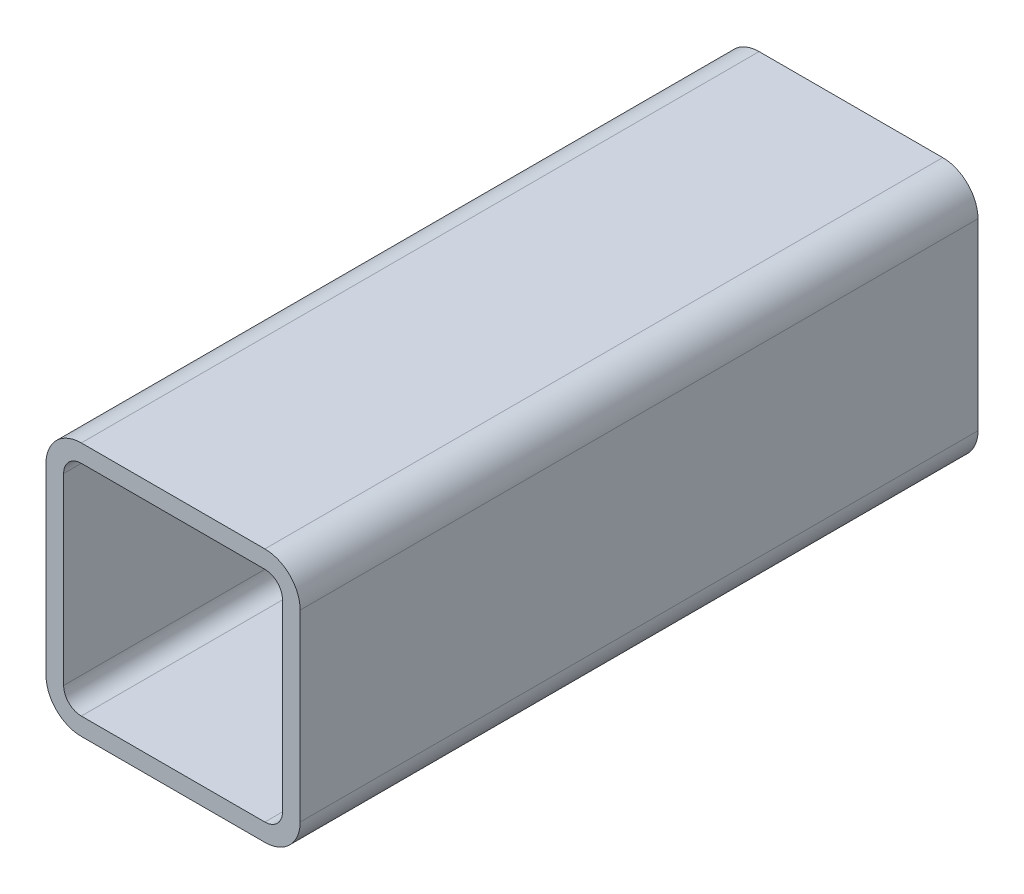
ISO-10303-21;
HEADER;
FILE_DESCRIPTION(('STEP AP214'),'2;1');
FILE_NAME('part.step','',(''),(''),'','','');
FILE_SCHEMA(('AUTOMOTIVE_DESIGN { 1 0 10303 214 1 1 1 1 }'));
ENDSEC;
DATA;
#1=APPLICATION_CONTEXT('core data for automotive mechanical design processes');
#2=APPLICATION_PROTOCOL_DEFINITION('international standard','automotive_design',2000,#1);
#3=PRODUCT_CONTEXT('',#1,'mechanical');
#4=PRODUCT('Part','Part','',(#3));
#5=PRODUCT_RELATED_PRODUCT_CATEGORY('part','',(#4));
#6=PRODUCT_DEFINITION_FORMATION('','',#4);
#7=PRODUCT_DEFINITION_CONTEXT('part definition',#1,'design');
#8=PRODUCT_DEFINITION('design','',#6,#7);
#9=PRODUCT_DEFINITION_SHAPE('','',#8);
#10=(LENGTH_UNIT() NAMED_UNIT(*) SI_UNIT(.MILLI.,.METRE.));
#11=(NAMED_UNIT(*) PLANE_ANGLE_UNIT() SI_UNIT($,.RADIAN.));
#12=(NAMED_UNIT(*) SI_UNIT($,.STERADIAN.) SOLID_ANGLE_UNIT());
#13=UNCERTAINTY_MEASURE_WITH_UNIT(LENGTH_MEASURE(1.E-05),#10,'distance_accuracy_value','');
#14=(GEOMETRIC_REPRESENTATION_CONTEXT(3) GLOBAL_UNCERTAINTY_ASSIGNED_CONTEXT((#13)) GLOBAL_UNIT_ASSIGNED_CONTEXT((#10,
#11,#12)) REPRESENTATION_CONTEXT('',''));
#15=CARTESIAN_POINT('',(0.,0.,0.));
#16=DIRECTION('',(0.,0.,1.));
#17=DIRECTION('',(1.,0.,0.));
#18=AXIS2_PLACEMENT_3D('',#15,#16,#17);
#19=CARTESIAN_POINT('',(17.1432087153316,99.2036017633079,304.8));
#20=DIRECTION('',(0.,0.,1.));
#21=DIRECTION('',(1.,0.,0.));
#22=AXIS2_PLACEMENT_3D('',#19,#20,#21);
#23=PLANE('',#22);
#24=CARTESIAN_POINT('',(17.1432087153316,99.2036017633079,304.8));
#25=DIRECTION('',(0.,0.,1.));
#26=DIRECTION('',(1.,0.,0.));
#27=AXIS2_PLACEMENT_3D('',#24,#25,#26);
#28=CIRCLE('',#27,15.875);
#29=CARTESIAN_POINT('',(17.1432087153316,115.078601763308,304.8));
#30=VERTEX_POINT('',#29);
#31=CARTESIAN_POINT('',(1.26820871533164,99.2036017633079,304.8));
#32=VERTEX_POINT('',#31);
#33=EDGE_CURVE('E211',#30,#32,#28,.T.);
#34=ORIENTED_EDGE('',*,*,#33,.T.);
#35=DIRECTION('',(0.,-1.,0.));
#36=VECTOR('',#35,1.);
#37=CARTESIAN_POINT('',(1.26820871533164,16.6536017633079,304.8));
#38=LINE('',#37,#36);
#39=CARTESIAN_POINT('',(1.26820871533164,16.6536017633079,304.8));
#40=VERTEX_POINT('',#39);
#41=EDGE_CURVE('E214',#32,#40,#38,.T.);
#42=ORIENTED_EDGE('',*,*,#41,.T.);
#43=CARTESIAN_POINT('',(17.1432087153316,16.6536017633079,304.8));
#44=DIRECTION('',(0.,0.,1.));
#45=DIRECTION('',(1.,0.,0.));
#46=AXIS2_PLACEMENT_3D('',#43,#44,#45);
#47=CIRCLE('',#46,15.875);
#48=CARTESIAN_POINT('',(17.1432087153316,0.77860176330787,304.8));
#49=VERTEX_POINT('',#48);
#50=EDGE_CURVE('E217',#40,#49,#47,.T.);
#51=ORIENTED_EDGE('',*,*,#50,.T.);
#52=DIRECTION('',(1.,0.,0.));
#53=VECTOR('',#52,1.);
#54=CARTESIAN_POINT('',(99.6932087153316,0.77860176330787,304.8));
#55=LINE('',#54,#53);
#56=CARTESIAN_POINT('',(99.6932087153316,0.778601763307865,304.8));
#57=VERTEX_POINT('',#56);
#58=EDGE_CURVE('E219',#49,#57,#55,.T.);
#59=ORIENTED_EDGE('',*,*,#58,.T.);
#60=CARTESIAN_POINT('',(99.6932087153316,16.6536017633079,304.8));
#61=DIRECTION('',(0.,0.,1.));
#62=DIRECTION('',(1.,0.,0.));
#63=AXIS2_PLACEMENT_3D('',#60,#61,#62);
#64=CIRCLE('',#63,15.875);
#65=CARTESIAN_POINT('',(115.568208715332,16.6536017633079,304.8));
#66=VERTEX_POINT('',#65);
#67=EDGE_CURVE('E221',#57,#66,#64,.T.);
#68=ORIENTED_EDGE('',*,*,#67,.T.);
#69=DIRECTION('',(0.,1.,0.));
#70=VECTOR('',#69,1.);
#71=CARTESIAN_POINT('',(115.568208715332,99.2036017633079,304.8));
#72=LINE('',#71,#70);
#73=CARTESIAN_POINT('',(115.568208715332,99.2036017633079,304.8));
#74=VERTEX_POINT('',#73);
#75=EDGE_CURVE('E223',#66,#74,#72,.T.);
#76=ORIENTED_EDGE('',*,*,#75,.T.);
#77=CARTESIAN_POINT('',(99.6932087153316,99.2036017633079,304.8));
#78=DIRECTION('',(0.,0.,1.));
#79=DIRECTION('',(1.,0.,0.));
#80=AXIS2_PLACEMENT_3D('',#77,#78,#79);
#81=CIRCLE('',#80,15.875);
#82=CARTESIAN_POINT('',(99.6932087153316,115.078601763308,304.8));
#83=VERTEX_POINT('',#82);
#84=EDGE_CURVE('E225',#74,#83,#81,.T.);
#85=ORIENTED_EDGE('',*,*,#84,.T.);
#86=DIRECTION('',(-1.,0.,0.));
#87=VECTOR('',#86,1.);
#88=CARTESIAN_POINT('',(17.1432087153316,115.078601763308,304.8));
#89=LINE('',#88,#87);
#90=EDGE_CURVE('E227',#83,#30,#89,.T.);
#91=ORIENTED_EDGE('',*,*,#90,.T.);
#92=EDGE_LOOP('',(#34,#42,#51,#59,#68,#76,#85,#91));
#93=FACE_BOUND('',#92,.T.);
#94=DIRECTION('',(0.,-1.,0.));
#95=VECTOR('',#94,1.);
#96=CARTESIAN_POINT('',(9.20570871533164,16.6536017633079,304.8));
#97=LINE('',#96,#95);
#98=CARTESIAN_POINT('',(9.20570871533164,99.2036017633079,304.8));
#99=VERTEX_POINT('',#98);
#100=CARTESIAN_POINT('',(9.20570871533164,16.6536017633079,304.8));
#101=VERTEX_POINT('',#100);
#102=EDGE_CURVE('E154',#99,#101,#97,.T.);
#103=ORIENTED_EDGE('',*,*,#102,.F.);
#104=CARTESIAN_POINT('',(17.1432087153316,99.2036017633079,304.8));
#105=DIRECTION('',(0.,0.,1.));
#106=DIRECTION('',(1.,0.,0.));
#107=AXIS2_PLACEMENT_3D('',#104,#105,#106);
#108=CIRCLE('',#107,7.9375);
#109=CARTESIAN_POINT('',(17.1432087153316,107.141101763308,304.8));
#110=VERTEX_POINT('',#109);
#111=EDGE_CURVE('E146',#110,#99,#108,.T.);
#112=ORIENTED_EDGE('',*,*,#111,.F.);
#113=DIRECTION('',(-1.,0.,0.));
#114=VECTOR('',#113,1.);
#115=CARTESIAN_POINT('',(17.1432087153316,107.141101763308,304.8));
#116=LINE('',#115,#114);
#117=CARTESIAN_POINT('',(99.6932087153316,107.141101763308,304.8));
#118=VERTEX_POINT('',#117);
#119=EDGE_CURVE('E179',#118,#110,#116,.T.);
#120=ORIENTED_EDGE('',*,*,#119,.F.);
#121=CARTESIAN_POINT('',(99.6932087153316,99.2036017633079,304.8));
#122=DIRECTION('',(0.,0.,1.));
#123=DIRECTION('',(1.,0.,0.));
#124=AXIS2_PLACEMENT_3D('',#121,#122,#123);
#125=CIRCLE('',#124,7.9375);
#126=CARTESIAN_POINT('',(107.630708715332,99.2036017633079,304.8));
#127=VERTEX_POINT('',#126);
#128=EDGE_CURVE('E177',#127,#118,#125,.T.);
#129=ORIENTED_EDGE('',*,*,#128,.F.);
#130=DIRECTION('',(0.,1.,0.));
#131=VECTOR('',#130,1.);
#132=CARTESIAN_POINT('',(107.630708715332,99.2036017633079,304.8));
#133=LINE('',#132,#131);
#134=CARTESIAN_POINT('',(107.630708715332,16.6536017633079,304.8));
#135=VERTEX_POINT('',#134);
#136=EDGE_CURVE('E175',#135,#127,#133,.T.);
#137=ORIENTED_EDGE('',*,*,#136,.F.);
#138=CARTESIAN_POINT('',(99.6932087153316,16.6536017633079,304.8));
#139=DIRECTION('',(0.,0.,1.));
#140=DIRECTION('',(1.,0.,0.));
#141=AXIS2_PLACEMENT_3D('',#138,#139,#140);
#142=CIRCLE('',#141,7.93750000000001);
#143=CARTESIAN_POINT('',(99.6932087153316,8.71610176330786,304.8));
#144=VERTEX_POINT('',#143);
#145=EDGE_CURVE('E173',#144,#135,#142,.T.);
#146=ORIENTED_EDGE('',*,*,#145,.F.);
#147=DIRECTION('',(1.,0.,0.));
#148=VECTOR('',#147,1.);
#149=CARTESIAN_POINT('',(99.6932087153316,8.71610176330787,304.8));
#150=LINE('',#149,#148);
#151=CARTESIAN_POINT('',(17.1432087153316,8.71610176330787,304.8));
#152=VERTEX_POINT('',#151);
#153=EDGE_CURVE('E169',#152,#144,#150,.T.);
#154=ORIENTED_EDGE('',*,*,#153,.F.);
#155=CARTESIAN_POINT('',(17.1432087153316,16.6536017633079,304.8));
#156=DIRECTION('',(0.,0.,1.));
#157=DIRECTION('',(1.,0.,0.));
#158=AXIS2_PLACEMENT_3D('',#155,#156,#157);
#159=CIRCLE('',#158,7.9375);
#160=EDGE_CURVE('E167',#101,#152,#159,.T.);
#161=ORIENTED_EDGE('',*,*,#160,.F.);
#162=EDGE_LOOP('',(#103,#112,#120,#129,#137,#146,#154,#161));
#163=FACE_BOUND('',#162,.T.);
#164=ADVANCED_FACE('F33',(#93,#163),#23,.T.);
#165=CARTESIAN_POINT('',(17.1432087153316,99.2036017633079,0.));
#166=DIRECTION('',(0.,0.,1.));
#167=DIRECTION('',(1.,0.,0.));
#168=AXIS2_PLACEMENT_3D('',#165,#166,#167);
#169=PLANE('',#168);
#170=CARTESIAN_POINT('',(17.1432087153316,99.2036017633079,0.));
#171=DIRECTION('',(0.,0.,1.));
#172=DIRECTION('',(1.,0.,0.));
#173=AXIS2_PLACEMENT_3D('',#170,#171,#172);
#174=CIRCLE('',#173,15.875);
#175=CARTESIAN_POINT('',(17.1432087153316,115.078601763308,0.));
#176=VERTEX_POINT('',#175);
#177=CARTESIAN_POINT('',(1.26820871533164,99.2036017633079,0.));
#178=VERTEX_POINT('',#177);
#179=EDGE_CURVE('E162',#176,#178,#174,.T.);
#180=ORIENTED_EDGE('',*,*,#179,.F.);
#181=DIRECTION('',(-1.,0.,0.));
#182=VECTOR('',#181,1.);
#183=CARTESIAN_POINT('',(17.1432087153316,115.078601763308,0.));
#184=LINE('',#183,#182);
#185=CARTESIAN_POINT('',(99.6932087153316,115.078601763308,0.));
#186=VERTEX_POINT('',#185);
#187=EDGE_CURVE('E215',#186,#176,#184,.T.);
#188=ORIENTED_EDGE('',*,*,#187,.F.);
#189=CARTESIAN_POINT('',(99.6932087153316,99.2036017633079,0.));
#190=DIRECTION('',(0.,0.,1.));
#191=DIRECTION('',(1.,0.,0.));
#192=AXIS2_PLACEMENT_3D('',#189,#190,#191);
#193=CIRCLE('',#192,15.875);
#194=CARTESIAN_POINT('',(115.568208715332,99.2036017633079,0.));
#195=VERTEX_POINT('',#194);
#196=EDGE_CURVE('E242',#195,#186,#193,.T.);
#197=ORIENTED_EDGE('',*,*,#196,.F.);
#198=DIRECTION('',(0.,1.,0.));
#199=VECTOR('',#198,1.);
#200=CARTESIAN_POINT('',(115.568208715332,99.2036017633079,0.));
#201=LINE('',#200,#199);
#202=CARTESIAN_POINT('',(115.568208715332,16.6536017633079,0.));
#203=VERTEX_POINT('',#202);
#204=EDGE_CURVE('E240',#203,#195,#201,.T.);
#205=ORIENTED_EDGE('',*,*,#204,.F.);
#206=CARTESIAN_POINT('',(99.6932087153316,16.6536017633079,0.));
#207=DIRECTION('',(0.,0.,1.));
#208=DIRECTION('',(1.,0.,0.));
#209=AXIS2_PLACEMENT_3D('',#206,#207,#208);
#210=CIRCLE('',#209,15.875);
#211=CARTESIAN_POINT('',(99.6932087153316,0.778601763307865,0.));
#212=VERTEX_POINT('',#211);
#213=EDGE_CURVE('E238',#212,#203,#210,.T.);
#214=ORIENTED_EDGE('',*,*,#213,.F.);
#215=DIRECTION('',(1.,0.,0.));
#216=VECTOR('',#215,1.);
#217=CARTESIAN_POINT('',(99.6932087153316,0.77860176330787,0.));
#218=LINE('',#217,#216);
#219=CARTESIAN_POINT('',(17.1432087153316,0.77860176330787,0.));
#220=VERTEX_POINT('',#219);
#221=EDGE_CURVE('E236',#220,#212,#218,.T.);
#222=ORIENTED_EDGE('',*,*,#221,.F.);
#223=CARTESIAN_POINT('',(17.1432087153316,16.6536017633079,0.));
#224=DIRECTION('',(0.,0.,1.));
#225=DIRECTION('',(1.,0.,0.));
#226=AXIS2_PLACEMENT_3D('',#223,#224,#225);
#227=CIRCLE('',#226,15.875);
#228=CARTESIAN_POINT('',(1.26820871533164,16.6536017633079,0.));
#229=VERTEX_POINT('',#228);
#230=EDGE_CURVE('E234',#229,#220,#227,.T.);
#231=ORIENTED_EDGE('',*,*,#230,.F.);
#232=DIRECTION('',(0.,-1.,0.));
#233=VECTOR('',#232,1.);
#234=CARTESIAN_POINT('',(1.26820871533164,16.6536017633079,0.));
#235=LINE('',#234,#233);
#236=EDGE_CURVE('E232',#178,#229,#235,.T.);
#237=ORIENTED_EDGE('',*,*,#236,.F.);
#238=EDGE_LOOP('',(#180,#188,#197,#205,#214,#222,#231,#237));
#239=FACE_BOUND('',#238,.T.);
#240=CARTESIAN_POINT('',(17.1432087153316,99.2036017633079,0.));
#241=DIRECTION('',(0.,0.,1.));
#242=DIRECTION('',(1.,0.,0.));
#243=AXIS2_PLACEMENT_3D('',#240,#241,#242);
#244=CIRCLE('',#243,7.9375);
#245=CARTESIAN_POINT('',(17.1432087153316,107.141101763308,0.));
#246=VERTEX_POINT('',#245);
#247=CARTESIAN_POINT('',(9.20570871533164,99.2036017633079,0.));
#248=VERTEX_POINT('',#247);
#249=EDGE_CURVE('E56',#246,#248,#244,.T.);
#250=ORIENTED_EDGE('',*,*,#249,.T.);
#251=DIRECTION('',(0.,-1.,0.));
#252=VECTOR('',#251,1.);
#253=CARTESIAN_POINT('',(9.20570871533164,16.6536017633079,0.));
#254=LINE('',#253,#252);
#255=CARTESIAN_POINT('',(9.20570871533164,16.6536017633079,0.));
#256=VERTEX_POINT('',#255);
#257=EDGE_CURVE('E161',#248,#256,#254,.T.);
#258=ORIENTED_EDGE('',*,*,#257,.T.);
#259=CARTESIAN_POINT('',(17.1432087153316,16.6536017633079,0.));
#260=DIRECTION('',(0.,0.,1.));
#261=DIRECTION('',(1.,0.,0.));
#262=AXIS2_PLACEMENT_3D('',#259,#260,#261);
#263=CIRCLE('',#262,7.9375);
#264=CARTESIAN_POINT('',(17.1432087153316,8.71610176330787,0.));
#265=VERTEX_POINT('',#264);
#266=EDGE_CURVE('E183',#256,#265,#263,.T.);
#267=ORIENTED_EDGE('',*,*,#266,.T.);
#268=DIRECTION('',(1.,0.,0.));
#269=VECTOR('',#268,1.);
#270=CARTESIAN_POINT('',(99.6932087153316,8.71610176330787,0.));
#271=LINE('',#270,#269);
#272=CARTESIAN_POINT('',(99.6932087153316,8.71610176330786,0.));
#273=VERTEX_POINT('',#272);
#274=EDGE_CURVE('E186',#265,#273,#271,.T.);
#275=ORIENTED_EDGE('',*,*,#274,.T.);
#276=CARTESIAN_POINT('',(99.6932087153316,16.6536017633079,0.));
#277=DIRECTION('',(0.,0.,1.));
#278=DIRECTION('',(1.,0.,0.));
#279=AXIS2_PLACEMENT_3D('',#276,#277,#278);
#280=CIRCLE('',#279,7.93750000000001);
#281=CARTESIAN_POINT('',(107.630708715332,16.6536017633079,0.));
#282=VERTEX_POINT('',#281);
#283=EDGE_CURVE('E189',#273,#282,#280,.T.);
#284=ORIENTED_EDGE('',*,*,#283,.T.);
#285=DIRECTION('',(0.,1.,0.));
#286=VECTOR('',#285,1.);
#287=CARTESIAN_POINT('',(107.630708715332,99.2036017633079,0.));
#288=LINE('',#287,#286);
#289=CARTESIAN_POINT('',(107.630708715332,99.2036017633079,0.));
#290=VERTEX_POINT('',#289);
#291=EDGE_CURVE('E192',#282,#290,#288,.T.);
#292=ORIENTED_EDGE('',*,*,#291,.T.);
#293=CARTESIAN_POINT('',(99.6932087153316,99.2036017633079,0.));
#294=DIRECTION('',(0.,0.,1.));
#295=DIRECTION('',(1.,0.,0.));
#296=AXIS2_PLACEMENT_3D('',#293,#294,#295);
#297=CIRCLE('',#296,7.9375);
#298=CARTESIAN_POINT('',(99.6932087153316,107.141101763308,0.));
#299=VERTEX_POINT('',#298);
#300=EDGE_CURVE('E195',#290,#299,#297,.T.);
#301=ORIENTED_EDGE('',*,*,#300,.T.);
#302=DIRECTION('',(-1.,0.,0.));
#303=VECTOR('',#302,1.);
#304=CARTESIAN_POINT('',(17.1432087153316,107.141101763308,0.));
#305=LINE('',#304,#303);
#306=EDGE_CURVE('E155',#299,#246,#305,.T.);
#307=ORIENTED_EDGE('',*,*,#306,.T.);
#308=EDGE_LOOP('',(#250,#258,#267,#275,#284,#292,#301,#307));
#309=FACE_BOUND('',#308,.T.);
#310=ADVANCED_FACE('F272',(#239,#309),#169,.F.);
#311=CARTESIAN_POINT('',(17.1432087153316,99.2036017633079,304.8));
#312=DIRECTION('',(0.,0.,-1.));
#313=DIRECTION('',(-1.,0.,0.));
#314=AXIS2_PLACEMENT_3D('',#311,#312,#313);
#315=CYLINDRICAL_SURFACE('',#314,15.875);
#316=ORIENTED_EDGE('',*,*,#179,.T.);
#317=DIRECTION('',(0.,0.,-1.));
#318=VECTOR('',#317,1.);
#319=CARTESIAN_POINT('',(1.26820871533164,99.2036017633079,304.8));
#320=LINE('',#319,#318);
#321=EDGE_CURVE('E11',#32,#178,#320,.T.);
#322=ORIENTED_EDGE('',*,*,#321,.F.);
#323=ORIENTED_EDGE('',*,*,#33,.F.);
#324=DIRECTION('',(0.,0.,-1.));
#325=VECTOR('',#324,1.);
#326=CARTESIAN_POINT('',(17.1432087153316,115.078601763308,304.8));
#327=LINE('',#326,#325);
#328=EDGE_CURVE('E229',#30,#176,#327,.T.);
#329=ORIENTED_EDGE('',*,*,#328,.T.);
#330=EDGE_LOOP('',(#316,#322,#323,#329));
#331=FACE_BOUND('',#330,.T.);
#332=ADVANCED_FACE('F35',(#331),#315,.T.);
#333=CARTESIAN_POINT('',(1.26820871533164,16.6536017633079,304.8));
#334=DIRECTION('',(1.,0.,0.));
#335=DIRECTION('',(0.,0.,-1.));
#336=AXIS2_PLACEMENT_3D('',#333,#334,#335);
#337=PLANE('',#336);
#338=ORIENTED_EDGE('',*,*,#236,.T.);
#339=DIRECTION('',(0.,0.,-1.));
#340=VECTOR('',#339,1.);
#341=CARTESIAN_POINT('',(1.26820871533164,16.6536017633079,304.8));
#342=LINE('',#341,#340);
#343=EDGE_CURVE('E41',#40,#229,#342,.T.);
#344=ORIENTED_EDGE('',*,*,#343,.F.);
#345=ORIENTED_EDGE('',*,*,#41,.F.);
#346=ORIENTED_EDGE('',*,*,#321,.T.);
#347=EDGE_LOOP('',(#338,#344,#345,#346));
#348=FACE_BOUND('',#347,.T.);
#349=ADVANCED_FACE('F289',(#348),#337,.F.);
#350=CARTESIAN_POINT('',(17.1432087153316,16.6536017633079,304.8));
#351=DIRECTION('',(0.,0.,-1.));
#352=DIRECTION('',(-1.,0.,0.));
#353=AXIS2_PLACEMENT_3D('',#350,#351,#352);
#354=CYLINDRICAL_SURFACE('',#353,15.875);
#355=ORIENTED_EDGE('',*,*,#230,.T.);
#356=DIRECTION('',(0.,0.,-1.));
#357=VECTOR('',#356,1.);
#358=CARTESIAN_POINT('',(17.1432087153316,0.77860176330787,304.8));
#359=LINE('',#358,#357);
#360=EDGE_CURVE('E259',#49,#220,#359,.T.);
#361=ORIENTED_EDGE('',*,*,#360,.F.);
#362=ORIENTED_EDGE('',*,*,#50,.F.);
#363=ORIENTED_EDGE('',*,*,#343,.T.);
#364=EDGE_LOOP('',(#355,#361,#362,#363));
#365=FACE_BOUND('',#364,.T.);
#366=ADVANCED_FACE('F266',(#365),#354,.T.);
#367=CARTESIAN_POINT('',(99.6932087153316,0.77860176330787,304.8));
#368=DIRECTION('',(0.,1.,0.));
#369=DIRECTION('',(0.,0.,1.));
#370=AXIS2_PLACEMENT_3D('',#367,#368,#369);
#371=PLANE('',#370);
#372=ORIENTED_EDGE('',*,*,#221,.T.);
#373=DIRECTION('',(0.,0.,-1.));
#374=VECTOR('',#373,1.);
#375=CARTESIAN_POINT('',(99.6932087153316,0.778601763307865,304.8));
#376=LINE('',#375,#374);
#377=EDGE_CURVE('E256',#57,#212,#376,.T.);
#378=ORIENTED_EDGE('',*,*,#377,.F.);
#379=ORIENTED_EDGE('',*,*,#58,.F.);
#380=ORIENTED_EDGE('',*,*,#360,.T.);
#381=EDGE_LOOP('',(#372,#378,#379,#380));
#382=FACE_BOUND('',#381,.T.);
#383=ADVANCED_FACE('F278',(#382),#371,.F.);
#384=CARTESIAN_POINT('',(99.6932087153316,16.6536017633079,304.8));
#385=DIRECTION('',(0.,0.,-1.));
#386=DIRECTION('',(-1.,0.,0.));
#387=AXIS2_PLACEMENT_3D('',#384,#385,#386);
#388=CYLINDRICAL_SURFACE('',#387,15.875);
#389=ORIENTED_EDGE('',*,*,#213,.T.);
#390=DIRECTION('',(0.,0.,-1.));
#391=VECTOR('',#390,1.);
#392=CARTESIAN_POINT('',(115.568208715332,16.6536017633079,304.8));
#393=LINE('',#392,#391);
#394=EDGE_CURVE('E253',#66,#203,#393,.T.);
#395=ORIENTED_EDGE('',*,*,#394,.F.);
#396=ORIENTED_EDGE('',*,*,#67,.F.);
#397=ORIENTED_EDGE('',*,*,#377,.T.);
#398=EDGE_LOOP('',(#389,#395,#396,#397));
#399=FACE_BOUND('',#398,.T.);
#400=ADVANCED_FACE('F282',(#399),#388,.T.);
#401=CARTESIAN_POINT('',(115.568208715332,99.2036017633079,304.8));
#402=DIRECTION('',(-1.,0.,0.));
#403=DIRECTION('',(0.,0.,1.));
#404=AXIS2_PLACEMENT_3D('',#401,#402,#403);
#405=PLANE('',#404);
#406=ORIENTED_EDGE('',*,*,#204,.T.);
#407=DIRECTION('',(0.,0.,-1.));
#408=VECTOR('',#407,1.);
#409=CARTESIAN_POINT('',(115.568208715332,99.2036017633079,304.8));
#410=LINE('',#409,#408);
#411=EDGE_CURVE('E250',#74,#195,#410,.T.);
#412=ORIENTED_EDGE('',*,*,#411,.F.);
#413=ORIENTED_EDGE('',*,*,#75,.F.);
#414=ORIENTED_EDGE('',*,*,#394,.T.);
#415=EDGE_LOOP('',(#406,#412,#413,#414));
#416=FACE_BOUND('',#415,.T.);
#417=ADVANCED_FACE('F302',(#416),#405,.F.);
#418=CARTESIAN_POINT('',(99.6932087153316,99.2036017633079,304.8));
#419=DIRECTION('',(0.,0.,-1.));
#420=DIRECTION('',(-1.,0.,0.));
#421=AXIS2_PLACEMENT_3D('',#418,#419,#420);
#422=CYLINDRICAL_SURFACE('',#421,15.875);
#423=ORIENTED_EDGE('',*,*,#196,.T.);
#424=DIRECTION('',(0.,0.,-1.));
#425=VECTOR('',#424,1.);
#426=CARTESIAN_POINT('',(99.6932087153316,115.078601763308,304.8));
#427=LINE('',#426,#425);
#428=EDGE_CURVE('E247',#83,#186,#427,.T.);
#429=ORIENTED_EDGE('',*,*,#428,.F.);
#430=ORIENTED_EDGE('',*,*,#84,.F.);
#431=ORIENTED_EDGE('',*,*,#411,.T.);
#432=EDGE_LOOP('',(#423,#429,#430,#431));
#433=FACE_BOUND('',#432,.T.);
#434=ADVANCED_FACE('F300',(#433),#422,.T.);
#435=CARTESIAN_POINT('',(17.1432087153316,115.078601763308,304.8));
#436=DIRECTION('',(0.,-1.,0.));
#437=DIRECTION('',(0.,0.,-1.));
#438=AXIS2_PLACEMENT_3D('',#435,#436,#437);
#439=PLANE('',#438);
#440=ORIENTED_EDGE('',*,*,#187,.T.);
#441=ORIENTED_EDGE('',*,*,#328,.F.);
#442=ORIENTED_EDGE('',*,*,#90,.F.);
#443=ORIENTED_EDGE('',*,*,#428,.T.);
#444=EDGE_LOOP('',(#440,#441,#442,#443));
#445=FACE_BOUND('',#444,.T.);
#446=ADVANCED_FACE('F295',(#445),#439,.F.);
#447=CARTESIAN_POINT('',(17.1432087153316,99.2036017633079,304.8));
#448=DIRECTION('',(0.,0.,-1.));
#449=DIRECTION('',(-1.,0.,0.));
#450=AXIS2_PLACEMENT_3D('',#447,#448,#449);
#451=CYLINDRICAL_SURFACE('',#450,7.9375);
#452=ORIENTED_EDGE('',*,*,#249,.F.);
#453=DIRECTION('',(0.,0.,-1.));
#454=VECTOR('',#453,1.);
#455=CARTESIAN_POINT('',(17.1432087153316,107.141101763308,304.8));
#456=LINE('',#455,#454);
#457=EDGE_CURVE('E150',#110,#246,#456,.T.);
#458=ORIENTED_EDGE('',*,*,#457,.F.);
#459=ORIENTED_EDGE('',*,*,#111,.T.);
#460=DIRECTION('',(0.,0.,-1.));
#461=VECTOR('',#460,1.);
#462=CARTESIAN_POINT('',(9.20570871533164,99.2036017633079,304.8));
#463=LINE('',#462,#461);
#464=EDGE_CURVE('E149',#99,#248,#463,.T.);
#465=ORIENTED_EDGE('',*,*,#464,.T.);
#466=EDGE_LOOP('',(#452,#458,#459,#465));
#467=FACE_BOUND('',#466,.T.);
#468=ADVANCED_FACE('F148',(#467),#451,.F.);
#469=CARTESIAN_POINT('',(9.20570871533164,16.6536017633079,304.8));
#470=DIRECTION('',(1.,0.,0.));
#471=DIRECTION('',(0.,0.,-1.));
#472=AXIS2_PLACEMENT_3D('',#469,#470,#471);
#473=PLANE('',#472);
#474=ORIENTED_EDGE('',*,*,#257,.F.);
#475=ORIENTED_EDGE('',*,*,#464,.F.);
#476=ORIENTED_EDGE('',*,*,#102,.T.);
#477=DIRECTION('',(0.,0.,-1.));
#478=VECTOR('',#477,1.);
#479=CARTESIAN_POINT('',(9.20570871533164,16.6536017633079,304.8));
#480=LINE('',#479,#478);
#481=EDGE_CURVE('E163',#101,#256,#480,.T.);
#482=ORIENTED_EDGE('',*,*,#481,.T.);
#483=EDGE_LOOP('',(#474,#475,#476,#482));
#484=FACE_BOUND('',#483,.T.);
#485=ADVANCED_FACE('F158',(#484),#473,.T.);
#486=CARTESIAN_POINT('',(17.1432087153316,16.6536017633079,304.8));
#487=DIRECTION('',(0.,0.,-1.));
#488=DIRECTION('',(-1.,0.,0.));
#489=AXIS2_PLACEMENT_3D('',#486,#487,#488);
#490=CYLINDRICAL_SURFACE('',#489,7.9375);
#491=ORIENTED_EDGE('',*,*,#266,.F.);
#492=ORIENTED_EDGE('',*,*,#481,.F.);
#493=ORIENTED_EDGE('',*,*,#160,.T.);
#494=DIRECTION('',(0.,0.,-1.));
#495=VECTOR('',#494,1.);
#496=CARTESIAN_POINT('',(17.1432087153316,8.71610176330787,304.8));
#497=LINE('',#496,#495);
#498=EDGE_CURVE('E208',#152,#265,#497,.T.);
#499=ORIENTED_EDGE('',*,*,#498,.T.);
#500=EDGE_LOOP('',(#491,#492,#493,#499));
#501=FACE_BOUND('',#500,.T.);
#502=ADVANCED_FACE('F327',(#501),#490,.F.);
#503=CARTESIAN_POINT('',(99.6932087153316,8.71610176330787,304.8));
#504=DIRECTION('',(0.,1.,0.));
#505=DIRECTION('',(0.,0.,1.));
#506=AXIS2_PLACEMENT_3D('',#503,#504,#505);
#507=PLANE('',#506);
#508=ORIENTED_EDGE('',*,*,#274,.F.);
#509=ORIENTED_EDGE('',*,*,#498,.F.);
#510=ORIENTED_EDGE('',*,*,#153,.T.);
#511=DIRECTION('',(0.,0.,-1.));
#512=VECTOR('',#511,1.);
#513=CARTESIAN_POINT('',(99.6932087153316,8.71610176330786,304.8));
#514=LINE('',#513,#512);
#515=EDGE_CURVE('E206',#144,#273,#514,.T.);
#516=ORIENTED_EDGE('',*,*,#515,.T.);
#517=EDGE_LOOP('',(#508,#509,#510,#516));
#518=FACE_BOUND('',#517,.T.);
#519=ADVANCED_FACE('F331',(#518),#507,.T.);
#520=CARTESIAN_POINT('',(99.6932087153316,16.6536017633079,304.8));
#521=DIRECTION('',(0.,0.,-1.));
#522=DIRECTION('',(-1.,0.,0.));
#523=AXIS2_PLACEMENT_3D('',#520,#521,#522);
#524=CYLINDRICAL_SURFACE('',#523,7.93750000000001);
#525=ORIENTED_EDGE('',*,*,#283,.F.);
#526=ORIENTED_EDGE('',*,*,#515,.F.);
#527=ORIENTED_EDGE('',*,*,#145,.T.);
#528=DIRECTION('',(0.,0.,-1.));
#529=VECTOR('',#528,1.);
#530=CARTESIAN_POINT('',(107.630708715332,16.6536017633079,304.8));
#531=LINE('',#530,#529);
#532=EDGE_CURVE('E204',#135,#282,#531,.T.);
#533=ORIENTED_EDGE('',*,*,#532,.T.);
#534=EDGE_LOOP('',(#525,#526,#527,#533));
#535=FACE_BOUND('',#534,.T.);
#536=ADVANCED_FACE('F337',(#535),#524,.F.);
#537=CARTESIAN_POINT('',(107.630708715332,99.2036017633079,304.8));
#538=DIRECTION('',(-1.,0.,0.));
#539=DIRECTION('',(0.,0.,1.));
#540=AXIS2_PLACEMENT_3D('',#537,#538,#539);
#541=PLANE('',#540);
#542=ORIENTED_EDGE('',*,*,#291,.F.);
#543=ORIENTED_EDGE('',*,*,#532,.F.);
#544=ORIENTED_EDGE('',*,*,#136,.T.);
#545=DIRECTION('',(0.,0.,-1.));
#546=VECTOR('',#545,1.);
#547=CARTESIAN_POINT('',(107.630708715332,99.2036017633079,304.8));
#548=LINE('',#547,#546);
#549=EDGE_CURVE('E202',#127,#290,#548,.T.);
#550=ORIENTED_EDGE('',*,*,#549,.T.);
#551=EDGE_LOOP('',(#542,#543,#544,#550));
#552=FACE_BOUND('',#551,.T.);
#553=ADVANCED_FACE('F341',(#552),#541,.T.);
#554=CARTESIAN_POINT('',(99.6932087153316,99.2036017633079,304.8));
#555=DIRECTION('',(0.,0.,-1.));
#556=DIRECTION('',(-1.,0.,0.));
#557=AXIS2_PLACEMENT_3D('',#554,#555,#556);
#558=CYLINDRICAL_SURFACE('',#557,7.9375);
#559=ORIENTED_EDGE('',*,*,#300,.F.);
#560=ORIENTED_EDGE('',*,*,#549,.F.);
#561=ORIENTED_EDGE('',*,*,#128,.T.);
#562=DIRECTION('',(0.,0.,-1.));
#563=VECTOR('',#562,1.);
#564=CARTESIAN_POINT('',(99.6932087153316,107.141101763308,304.8));
#565=LINE('',#564,#563);
#566=EDGE_CURVE('E48',#118,#299,#565,.T.);
#567=ORIENTED_EDGE('',*,*,#566,.T.);
#568=EDGE_LOOP('',(#559,#560,#561,#567));
#569=FACE_BOUND('',#568,.T.);
#570=ADVANCED_FACE('F345',(#569),#558,.F.);
#571=CARTESIAN_POINT('',(17.1432087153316,107.141101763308,304.8));
#572=DIRECTION('',(0.,-1.,0.));
#573=DIRECTION('',(0.,0.,-1.));
#574=AXIS2_PLACEMENT_3D('',#571,#572,#573);
#575=PLANE('',#574);
#576=ORIENTED_EDGE('',*,*,#306,.F.);
#577=ORIENTED_EDGE('',*,*,#566,.F.);
#578=ORIENTED_EDGE('',*,*,#119,.T.);
#579=ORIENTED_EDGE('',*,*,#457,.T.);
#580=EDGE_LOOP('',(#576,#577,#578,#579));
#581=FACE_BOUND('',#580,.T.);
#582=ADVANCED_FACE('F349',(#581),#575,.T.);
#583=CLOSED_SHELL('',(#164,#310,#332,#349,#366,#383,#400,#417,#434,#446,#468,#485,#502,#519,
#536,#553,#570,#582));
#584=MANIFOLD_SOLID_BREP('B2',#583);
#585=ADVANCED_BREP_SHAPE_REPRESENTATION('',(#18,#584),#14);
#586=SHAPE_DEFINITION_REPRESENTATION(#9,#585);
ENDSEC;
END-ISO-10303-21;
